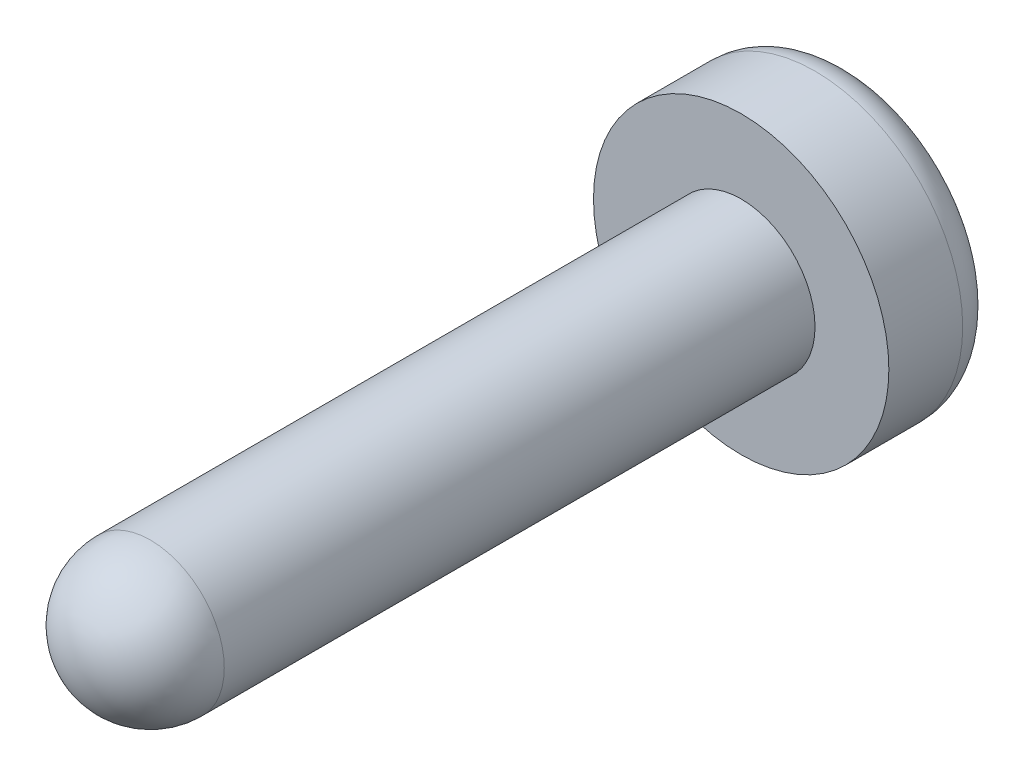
ISO-10303-21;
HEADER;
FILE_DESCRIPTION(('STEP AP214'),'2;1');
FILE_NAME('part.step','',(''),(''),'','','');
FILE_SCHEMA(('AUTOMOTIVE_DESIGN { 1 0 10303 214 1 1 1 1 }'));
ENDSEC;
DATA;
#1=APPLICATION_CONTEXT('core data for automotive mechanical design processes');
#2=APPLICATION_PROTOCOL_DEFINITION('international standard','automotive_design',2000,#1);
#3=PRODUCT_CONTEXT('',#1,'mechanical');
#4=PRODUCT('Part','Part','',(#3));
#5=PRODUCT_RELATED_PRODUCT_CATEGORY('part','',(#4));
#6=PRODUCT_DEFINITION_FORMATION('','',#4);
#7=PRODUCT_DEFINITION_CONTEXT('part definition',#1,'design');
#8=PRODUCT_DEFINITION('design','',#6,#7);
#9=PRODUCT_DEFINITION_SHAPE('','',#8);
#10=(LENGTH_UNIT() NAMED_UNIT(*) SI_UNIT(.MILLI.,.METRE.));
#11=(NAMED_UNIT(*) PLANE_ANGLE_UNIT() SI_UNIT($,.RADIAN.));
#12=(NAMED_UNIT(*) SI_UNIT($,.STERADIAN.) SOLID_ANGLE_UNIT());
#13=UNCERTAINTY_MEASURE_WITH_UNIT(LENGTH_MEASURE(1.E-05),#10,'distance_accuracy_value','');
#14=(GEOMETRIC_REPRESENTATION_CONTEXT(3) GLOBAL_UNCERTAINTY_ASSIGNED_CONTEXT((#13)) GLOBAL_UNIT_ASSIGNED_CONTEXT((#10,
#11,#12)) REPRESENTATION_CONTEXT('',''));
#15=CARTESIAN_POINT('',(0.,0.,0.));
#16=DIRECTION('',(0.,0.,1.));
#17=DIRECTION('',(1.,0.,0.));
#18=AXIS2_PLACEMENT_3D('',#15,#16,#17);
#19=CARTESIAN_POINT('',(0.,0.,1.5));
#20=DIRECTION('',(0.,0.,-1.));
#21=DIRECTION('',(-1.,0.,0.));
#22=AXIS2_PLACEMENT_3D('',#19,#20,#21);
#23=CYLINDRICAL_SURFACE('',#22,2.);
#24=CARTESIAN_POINT('',(0.,0.,0.5));
#25=DIRECTION('',(0.,0.,1.));
#26=DIRECTION('',(1.,0.,0.));
#27=AXIS2_PLACEMENT_3D('',#24,#25,#26);
#28=CIRCLE('',#27,2.);
#29=CARTESIAN_POINT('',(2.,0.,0.5));
#30=VERTEX_POINT('',#29);
#31=EDGE_CURVE('E49',#30,#30,#28,.T.);
#32=ORIENTED_EDGE('',*,*,#31,.T.);
#33=EDGE_LOOP('',(#32));
#34=FACE_BOUND('',#33,.T.);
#35=CARTESIAN_POINT('',(0.,0.,1.5));
#36=DIRECTION('',(0.,0.,1.));
#37=DIRECTION('',(1.,0.,0.));
#38=AXIS2_PLACEMENT_3D('',#35,#36,#37);
#39=CIRCLE('',#38,2.);
#40=CARTESIAN_POINT('',(2.,0.,1.5));
#41=VERTEX_POINT('',#40);
#42=EDGE_CURVE('E243',#41,#41,#39,.T.);
#43=ORIENTED_EDGE('',*,*,#42,.F.);
#44=EDGE_LOOP('',(#43));
#45=FACE_BOUND('',#44,.T.);
#46=ADVANCED_FACE('F40',(#34,#45),#23,.T.);
#47=CARTESIAN_POINT('',(0.,0.,1.5));
#48=DIRECTION('',(0.,0.,1.));
#49=DIRECTION('',(1.,0.,0.));
#50=AXIS2_PLACEMENT_3D('',#47,#48,#49);
#51=PLANE('',#50);
#52=CARTESIAN_POINT('',(0.,0.,1.5));
#53=DIRECTION('',(0.,0.,1.));
#54=DIRECTION('',(1.,0.,0.));
#55=AXIS2_PLACEMENT_3D('',#52,#53,#54);
#56=CIRCLE('',#55,1.);
#57=CARTESIAN_POINT('',(1.,0.,1.5));
#58=VERTEX_POINT('',#57);
#59=EDGE_CURVE('E212',#58,#58,#56,.T.);
#60=ORIENTED_EDGE('',*,*,#59,.F.);
#61=EDGE_LOOP('',(#60));
#62=FACE_BOUND('',#61,.T.);
#63=ORIENTED_EDGE('',*,*,#42,.T.);
#64=EDGE_LOOP('',(#63));
#65=FACE_BOUND('',#64,.T.);
#66=ADVANCED_FACE('F270',(#62,#65),#51,.T.);
#67=CARTESIAN_POINT('',(0.,0.,0.));
#68=DIRECTION('',(0.,0.,1.));
#69=DIRECTION('',(1.,0.,0.));
#70=AXIS2_PLACEMENT_3D('',#67,#68,#69);
#71=PLANE('',#70);
#72=DIRECTION('',(-1.,0.,0.));
#73=VECTOR('',#72,1.);
#74=CARTESIAN_POINT('',(0.,-0.358007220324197,0.));
#75=LINE('',#74,#73);
#76=CARTESIAN_POINT('',(1.14604795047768,-0.358007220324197,0.));
#77=VERTEX_POINT('',#76);
#78=CARTESIAN_POINT('',(0.316520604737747,-0.358007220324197,0.));
#79=VERTEX_POINT('',#78);
#80=EDGE_CURVE('E168',#77,#79,#75,.T.);
#81=ORIENTED_EDGE('',*,*,#80,.F.);
#82=DIRECTION('',(0.,-1.,0.));
#83=VECTOR('',#82,1.);
#84=CARTESIAN_POINT('',(1.14604795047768,0.,0.));
#85=LINE('',#84,#83);
#86=CARTESIAN_POINT('',(1.14604795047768,0.271500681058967,0.));
#87=VERTEX_POINT('',#86);
#88=EDGE_CURVE('E56',#87,#77,#85,.T.);
#89=ORIENTED_EDGE('',*,*,#88,.F.);
#90=DIRECTION('',(-1.,0.,0.));
#91=VECTOR('',#90,1.);
#92=CARTESIAN_POINT('',(0.,0.271500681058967,0.));
#93=LINE('',#92,#91);
#94=CARTESIAN_POINT('',(0.316520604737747,0.271500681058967,0.));
#95=VERTEX_POINT('',#94);
#96=EDGE_CURVE('E205',#87,#95,#93,.T.);
#97=ORIENTED_EDGE('',*,*,#96,.T.);
#98=DIRECTION('',(0.,-1.,0.));
#99=VECTOR('',#98,1.);
#100=CARTESIAN_POINT('',(0.316520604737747,0.,0.));
#101=LINE('',#100,#99);
#102=CARTESIAN_POINT('',(0.316520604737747,1.14319061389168,0.));
#103=VERTEX_POINT('',#102);
#104=EDGE_CURVE('E202',#103,#95,#101,.T.);
#105=ORIENTED_EDGE('',*,*,#104,.F.);
#106=DIRECTION('',(-1.,0.,0.));
#107=VECTOR('',#106,1.);
#108=CARTESIAN_POINT('',(0.,1.14319061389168,0.));
#109=LINE('',#108,#107);
#110=CARTESIAN_POINT('',(-0.315681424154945,1.14319061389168,0.));
#111=VERTEX_POINT('',#110);
#112=EDGE_CURVE('E138',#103,#111,#109,.T.);
#113=ORIENTED_EDGE('',*,*,#112,.T.);
#114=DIRECTION('',(0.,-1.,0.));
#115=VECTOR('',#114,1.);
#116=CARTESIAN_POINT('',(-0.315681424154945,0.,0.));
#117=LINE('',#116,#115);
#118=CARTESIAN_POINT('',(-0.315681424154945,0.271500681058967,0.));
#119=VERTEX_POINT('',#118);
#120=EDGE_CURVE('E196',#111,#119,#117,.T.);
#121=ORIENTED_EDGE('',*,*,#120,.T.);
#122=DIRECTION('',(-1.,0.,0.));
#123=VECTOR('',#122,1.);
#124=CARTESIAN_POINT('',(0.,0.271500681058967,0.));
#125=LINE('',#124,#123);
#126=CARTESIAN_POINT('',(-1.18817139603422,0.271500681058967,0.));
#127=VERTEX_POINT('',#126);
#128=EDGE_CURVE('E192',#119,#127,#125,.T.);
#129=ORIENTED_EDGE('',*,*,#128,.T.);
#130=DIRECTION('',(0.,-1.,0.));
#131=VECTOR('',#130,1.);
#132=CARTESIAN_POINT('',(-1.18817139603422,0.,0.));
#133=LINE('',#132,#131);
#134=CARTESIAN_POINT('',(-1.18817139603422,-0.358007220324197,0.));
#135=VERTEX_POINT('',#134);
#136=EDGE_CURVE('E188',#127,#135,#133,.T.);
#137=ORIENTED_EDGE('',*,*,#136,.T.);
#138=DIRECTION('',(-1.,0.,0.));
#139=VECTOR('',#138,1.);
#140=CARTESIAN_POINT('',(0.,-0.358007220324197,0.));
#141=LINE('',#140,#139);
#142=CARTESIAN_POINT('',(-0.315681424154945,-0.358007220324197,0.));
#143=VERTEX_POINT('',#142);
#144=EDGE_CURVE('E184',#143,#135,#141,.T.);
#145=ORIENTED_EDGE('',*,*,#144,.F.);
#146=DIRECTION('',(0.,-1.,0.));
#147=VECTOR('',#146,1.);
#148=CARTESIAN_POINT('',(-0.315681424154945,0.,0.));
#149=LINE('',#148,#147);
#150=CARTESIAN_POINT('',(-0.315681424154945,-1.21651623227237,0.));
#151=VERTEX_POINT('',#150);
#152=EDGE_CURVE('E180',#143,#151,#149,.T.);
#153=ORIENTED_EDGE('',*,*,#152,.T.);
#154=DIRECTION('',(-1.,0.,0.));
#155=VECTOR('',#154,1.);
#156=CARTESIAN_POINT('',(0.,-1.21651623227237,0.));
#157=LINE('',#156,#155);
#158=CARTESIAN_POINT('',(0.316520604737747,-1.21651623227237,0.));
#159=VERTEX_POINT('',#158);
#160=EDGE_CURVE('E176',#159,#151,#157,.T.);
#161=ORIENTED_EDGE('',*,*,#160,.F.);
#162=DIRECTION('',(0.,-1.,0.));
#163=VECTOR('',#162,1.);
#164=CARTESIAN_POINT('',(0.316520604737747,0.,0.));
#165=LINE('',#164,#163);
#166=EDGE_CURVE('E172',#79,#159,#165,.T.);
#167=ORIENTED_EDGE('',*,*,#166,.F.);
#168=EDGE_LOOP('',(#81,#89,#97,#105,#113,#121,#129,#137,#145,#153,#161,#167));
#169=FACE_BOUND('',#168,.T.);
#170=CARTESIAN_POINT('',(0.,0.,0.));
#171=DIRECTION('',(0.,0.,1.));
#172=DIRECTION('',(1.,0.,0.));
#173=AXIS2_PLACEMENT_3D('',#170,#171,#172);
#174=CIRCLE('',#173,1.5);
#175=CARTESIAN_POINT('',(1.5,0.,0.));
#176=VERTEX_POINT('',#175);
#177=EDGE_CURVE('E11',#176,#176,#174,.F.);
#178=ORIENTED_EDGE('',*,*,#177,.T.);
#179=EDGE_LOOP('',(#178));
#180=FACE_BOUND('',#179,.T.);
#181=ADVANCED_FACE('F275',(#169,#180),#71,.F.);
#182=CARTESIAN_POINT('',(0.,0.,10.5));
#183=DIRECTION('',(0.,0.,-1.));
#184=DIRECTION('',(-1.,0.,0.));
#185=AXIS2_PLACEMENT_3D('',#182,#183,#184);
#186=CYLINDRICAL_SURFACE('',#185,1.);
#187=CARTESIAN_POINT('',(0.,0.,9.5));
#188=DIRECTION('',(0.,0.,-1.));
#189=DIRECTION('',(-1.,0.,0.));
#190=AXIS2_PLACEMENT_3D('',#187,#188,#189);
#191=CIRCLE('',#190,1.);
#192=CARTESIAN_POINT('',(-1.,0.,9.5));
#193=VERTEX_POINT('',#192);
#194=EDGE_CURVE('E247',#193,#193,#191,.T.);
#195=ORIENTED_EDGE('',*,*,#194,.T.);
#196=EDGE_LOOP('',(#195));
#197=FACE_BOUND('',#196,.T.);
#198=ORIENTED_EDGE('',*,*,#59,.T.);
#199=EDGE_LOOP('',(#198));
#200=FACE_BOUND('',#199,.T.);
#201=ADVANCED_FACE('F266',(#197,#200),#186,.T.);
#202=CARTESIAN_POINT('',(0.,0.,9.5));
#203=DIRECTION('',(0.,0.,1.));
#204=DIRECTION('',(1.,0.,0.));
#205=AXIS2_PLACEMENT_3D('',#202,#203,#204);
#206=SPHERICAL_SURFACE('',#205,1.);
#207=ORIENTED_EDGE('',*,*,#194,.F.);
#208=EDGE_LOOP('',(#207));
#209=FACE_BOUND('',#208,.T.);
#210=ADVANCED_FACE('F258',(#209),#206,.T.);
#211=CARTESIAN_POINT('',(0.,0.,0.5));
#212=DIRECTION('',(0.,0.,1.));
#213=DIRECTION('',(1.,0.,0.));
#214=AXIS2_PLACEMENT_3D('',#211,#212,#213);
#215=TOROIDAL_SURFACE('',#214,1.5,0.5);
#216=ORIENTED_EDGE('',*,*,#177,.F.);
#217=EDGE_LOOP('',(#216));
#218=FACE_BOUND('',#217,.T.);
#219=ORIENTED_EDGE('',*,*,#31,.F.);
#220=EDGE_LOOP('',(#219));
#221=FACE_BOUND('',#220,.T.);
#222=ADVANCED_FACE('F42',(#218,#221),#215,.T.);
#223=CARTESIAN_POINT('',(1.14604795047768,0.,0.5));
#224=DIRECTION('',(1.,0.,0.));
#225=DIRECTION('',(0.,0.,-1.));
#226=AXIS2_PLACEMENT_3D('',#223,#224,#225);
#227=PLANE('',#226);
#228=ORIENTED_EDGE('',*,*,#88,.T.);
#229=DIRECTION('',(0.,0.,-1.));
#230=VECTOR('',#229,1.);
#231=CARTESIAN_POINT('',(1.14604795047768,-0.358007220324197,0.5));
#232=LINE('',#231,#230);
#233=CARTESIAN_POINT('',(1.14604795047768,-0.358007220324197,0.5));
#234=VERTEX_POINT('',#233);
#235=EDGE_CURVE('E104',#234,#77,#232,.T.);
#236=ORIENTED_EDGE('',*,*,#235,.F.);
#237=DIRECTION('',(0.,-1.,0.));
#238=VECTOR('',#237,1.);
#239=CARTESIAN_POINT('',(1.14604795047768,0.,0.5));
#240=LINE('',#239,#238);
#241=CARTESIAN_POINT('',(1.14604795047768,0.271500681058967,0.5));
#242=VERTEX_POINT('',#241);
#243=EDGE_CURVE('E209',#242,#234,#240,.T.);
#244=ORIENTED_EDGE('',*,*,#243,.F.);
#245=DIRECTION('',(0.,0.,-1.));
#246=VECTOR('',#245,1.);
#247=CARTESIAN_POINT('',(1.14604795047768,0.271500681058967,0.5));
#248=LINE('',#247,#246);
#249=EDGE_CURVE('E64',#242,#87,#248,.T.);
#250=ORIENTED_EDGE('',*,*,#249,.T.);
#251=EDGE_LOOP('',(#228,#236,#244,#250));
#252=FACE_BOUND('',#251,.T.);
#253=ADVANCED_FACE('F257',(#252),#227,.F.);
#254=CARTESIAN_POINT('',(0.,0.271500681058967,0.5));
#255=DIRECTION('',(0.,-1.,0.));
#256=DIRECTION('',(0.,0.,-1.));
#257=AXIS2_PLACEMENT_3D('',#254,#255,#256);
#258=PLANE('',#257);
#259=ORIENTED_EDGE('',*,*,#96,.F.);
#260=ORIENTED_EDGE('',*,*,#249,.F.);
#261=DIRECTION('',(-1.,0.,0.));
#262=VECTOR('',#261,1.);
#263=CARTESIAN_POINT('',(0.,0.271500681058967,0.5));
#264=LINE('',#263,#262);
#265=CARTESIAN_POINT('',(0.316520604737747,0.271500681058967,0.5));
#266=VERTEX_POINT('',#265);
#267=EDGE_CURVE('E160',#242,#266,#264,.T.);
#268=ORIENTED_EDGE('',*,*,#267,.T.);
#269=DIRECTION('',(0.,0.,-1.));
#270=VECTOR('',#269,1.);
#271=CARTESIAN_POINT('',(0.316520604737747,0.271500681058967,0.5));
#272=LINE('',#271,#270);
#273=EDGE_CURVE('E144',#266,#95,#272,.T.);
#274=ORIENTED_EDGE('',*,*,#273,.T.);
#275=EDGE_LOOP('',(#259,#260,#268,#274));
#276=FACE_BOUND('',#275,.T.);
#277=ADVANCED_FACE('F264',(#276),#258,.T.);
#278=CARTESIAN_POINT('',(0.316520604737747,0.,0.5));
#279=DIRECTION('',(1.,0.,0.));
#280=DIRECTION('',(0.,0.,-1.));
#281=AXIS2_PLACEMENT_3D('',#278,#279,#280);
#282=PLANE('',#281);
#283=ORIENTED_EDGE('',*,*,#104,.T.);
#284=ORIENTED_EDGE('',*,*,#273,.F.);
#285=DIRECTION('',(0.,-1.,0.));
#286=VECTOR('',#285,1.);
#287=CARTESIAN_POINT('',(0.316520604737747,0.,0.5));
#288=LINE('',#287,#286);
#289=CARTESIAN_POINT('',(0.316520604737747,1.14319061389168,0.5));
#290=VERTEX_POINT('',#289);
#291=EDGE_CURVE('E152',#290,#266,#288,.T.);
#292=ORIENTED_EDGE('',*,*,#291,.F.);
#293=DIRECTION('',(0.,0.,-1.));
#294=VECTOR('',#293,1.);
#295=CARTESIAN_POINT('',(0.316520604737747,1.14319061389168,0.5));
#296=LINE('',#295,#294);
#297=EDGE_CURVE('E132',#290,#103,#296,.T.);
#298=ORIENTED_EDGE('',*,*,#297,.T.);
#299=EDGE_LOOP('',(#283,#284,#292,#298));
#300=FACE_BOUND('',#299,.T.);
#301=ADVANCED_FACE('F158',(#300),#282,.F.);
#302=CARTESIAN_POINT('',(0.,1.14319061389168,0.5));
#303=DIRECTION('',(0.,-1.,0.));
#304=DIRECTION('',(0.,0.,-1.));
#305=AXIS2_PLACEMENT_3D('',#302,#303,#304);
#306=PLANE('',#305);
#307=ORIENTED_EDGE('',*,*,#112,.F.);
#308=ORIENTED_EDGE('',*,*,#297,.F.);
#309=DIRECTION('',(-1.,0.,0.));
#310=VECTOR('',#309,1.);
#311=CARTESIAN_POINT('',(0.,1.14319061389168,0.5));
#312=LINE('',#311,#310);
#313=CARTESIAN_POINT('',(-0.315681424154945,1.14319061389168,0.5));
#314=VERTEX_POINT('',#313);
#315=EDGE_CURVE('E135',#290,#314,#312,.T.);
#316=ORIENTED_EDGE('',*,*,#315,.T.);
#317=DIRECTION('',(0.,0.,-1.));
#318=VECTOR('',#317,1.);
#319=CARTESIAN_POINT('',(-0.315681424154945,1.14319061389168,0.5));
#320=LINE('',#319,#318);
#321=EDGE_CURVE('E145',#314,#111,#320,.T.);
#322=ORIENTED_EDGE('',*,*,#321,.T.);
#323=EDGE_LOOP('',(#307,#308,#316,#322));
#324=FACE_BOUND('',#323,.T.);
#325=ADVANCED_FACE('F134',(#324),#306,.T.);
#326=CARTESIAN_POINT('',(-0.315681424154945,0.,0.5));
#327=DIRECTION('',(1.,0.,0.));
#328=DIRECTION('',(0.,0.,-1.));
#329=AXIS2_PLACEMENT_3D('',#326,#327,#328);
#330=PLANE('',#329);
#331=ORIENTED_EDGE('',*,*,#120,.F.);
#332=ORIENTED_EDGE('',*,*,#321,.F.);
#333=DIRECTION('',(0.,-1.,0.));
#334=VECTOR('',#333,1.);
#335=CARTESIAN_POINT('',(-0.315681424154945,0.,0.5));
#336=LINE('',#335,#334);
#337=CARTESIAN_POINT('',(-0.315681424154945,0.271500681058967,0.5));
#338=VERTEX_POINT('',#337);
#339=EDGE_CURVE('E154',#314,#338,#336,.T.);
#340=ORIENTED_EDGE('',*,*,#339,.T.);
#341=DIRECTION('',(0.,0.,-1.));
#342=VECTOR('',#341,1.);
#343=CARTESIAN_POINT('',(-0.315681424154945,0.271500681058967,0.5));
#344=LINE('',#343,#342);
#345=EDGE_CURVE('E217',#338,#119,#344,.T.);
#346=ORIENTED_EDGE('',*,*,#345,.T.);
#347=EDGE_LOOP('',(#331,#332,#340,#346));
#348=FACE_BOUND('',#347,.T.);
#349=ADVANCED_FACE('F312',(#348),#330,.T.);
#350=CARTESIAN_POINT('',(0.,0.271500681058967,0.5));
#351=DIRECTION('',(0.,-1.,0.));
#352=DIRECTION('',(0.,0.,-1.));
#353=AXIS2_PLACEMENT_3D('',#350,#351,#352);
#354=PLANE('',#353);
#355=ORIENTED_EDGE('',*,*,#128,.F.);
#356=ORIENTED_EDGE('',*,*,#345,.F.);
#357=DIRECTION('',(-1.,0.,0.));
#358=VECTOR('',#357,1.);
#359=CARTESIAN_POINT('',(0.,0.271500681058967,0.5));
#360=LINE('',#359,#358);
#361=CARTESIAN_POINT('',(-1.18817139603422,0.271500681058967,0.5));
#362=VERTEX_POINT('',#361);
#363=EDGE_CURVE('E473',#338,#362,#360,.T.);
#364=ORIENTED_EDGE('',*,*,#363,.T.);
#365=DIRECTION('',(0.,0.,-1.));
#366=VECTOR('',#365,1.);
#367=CARTESIAN_POINT('',(-1.18817139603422,0.271500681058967,0.5));
#368=LINE('',#367,#366);
#369=EDGE_CURVE('E220',#362,#127,#368,.T.);
#370=ORIENTED_EDGE('',*,*,#369,.T.);
#371=EDGE_LOOP('',(#355,#356,#364,#370));
#372=FACE_BOUND('',#371,.T.);
#373=ADVANCED_FACE('F308',(#372),#354,.T.);
#374=CARTESIAN_POINT('',(-1.18817139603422,0.,0.5));
#375=DIRECTION('',(1.,0.,0.));
#376=DIRECTION('',(0.,0.,-1.));
#377=AXIS2_PLACEMENT_3D('',#374,#375,#376);
#378=PLANE('',#377);
#379=ORIENTED_EDGE('',*,*,#136,.F.);
#380=ORIENTED_EDGE('',*,*,#369,.F.);
#381=DIRECTION('',(0.,-1.,0.));
#382=VECTOR('',#381,1.);
#383=CARTESIAN_POINT('',(-1.18817139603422,0.,0.5));
#384=LINE('',#383,#382);
#385=CARTESIAN_POINT('',(-1.18817139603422,-0.358007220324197,0.5));
#386=VERTEX_POINT('',#385);
#387=EDGE_CURVE('E470',#362,#386,#384,.T.);
#388=ORIENTED_EDGE('',*,*,#387,.T.);
#389=DIRECTION('',(0.,0.,-1.));
#390=VECTOR('',#389,1.);
#391=CARTESIAN_POINT('',(-1.18817139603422,-0.358007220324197,0.5));
#392=LINE('',#391,#390);
#393=EDGE_CURVE('E223',#386,#135,#392,.T.);
#394=ORIENTED_EDGE('',*,*,#393,.T.);
#395=EDGE_LOOP('',(#379,#380,#388,#394));
#396=FACE_BOUND('',#395,.T.);
#397=ADVANCED_FACE('F304',(#396),#378,.T.);
#398=CARTESIAN_POINT('',(0.,-0.358007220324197,0.5));
#399=DIRECTION('',(0.,-1.,0.));
#400=DIRECTION('',(0.,0.,-1.));
#401=AXIS2_PLACEMENT_3D('',#398,#399,#400);
#402=PLANE('',#401);
#403=ORIENTED_EDGE('',*,*,#144,.T.);
#404=ORIENTED_EDGE('',*,*,#393,.F.);
#405=DIRECTION('',(-1.,0.,0.));
#406=VECTOR('',#405,1.);
#407=CARTESIAN_POINT('',(0.,-0.358007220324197,0.5));
#408=LINE('',#407,#406);
#409=CARTESIAN_POINT('',(-0.315681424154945,-0.358007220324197,0.5));
#410=VERTEX_POINT('',#409);
#411=EDGE_CURVE('E466',#410,#386,#408,.T.);
#412=ORIENTED_EDGE('',*,*,#411,.F.);
#413=DIRECTION('',(0.,0.,-1.));
#414=VECTOR('',#413,1.);
#415=CARTESIAN_POINT('',(-0.315681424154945,-0.358007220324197,0.5));
#416=LINE('',#415,#414);
#417=EDGE_CURVE('E226',#410,#143,#416,.T.);
#418=ORIENTED_EDGE('',*,*,#417,.T.);
#419=EDGE_LOOP('',(#403,#404,#412,#418));
#420=FACE_BOUND('',#419,.T.);
#421=ADVANCED_FACE('F300',(#420),#402,.F.);
#422=CARTESIAN_POINT('',(-0.315681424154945,0.,0.5));
#423=DIRECTION('',(1.,0.,0.));
#424=DIRECTION('',(0.,0.,-1.));
#425=AXIS2_PLACEMENT_3D('',#422,#423,#424);
#426=PLANE('',#425);
#427=ORIENTED_EDGE('',*,*,#152,.F.);
#428=ORIENTED_EDGE('',*,*,#417,.F.);
#429=DIRECTION('',(0.,-1.,0.));
#430=VECTOR('',#429,1.);
#431=CARTESIAN_POINT('',(-0.315681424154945,0.,0.5));
#432=LINE('',#431,#430);
#433=CARTESIAN_POINT('',(-0.315681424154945,-1.21651623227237,0.5));
#434=VERTEX_POINT('',#433);
#435=EDGE_CURVE('E463',#410,#434,#432,.T.);
#436=ORIENTED_EDGE('',*,*,#435,.T.);
#437=DIRECTION('',(0.,0.,-1.));
#438=VECTOR('',#437,1.);
#439=CARTESIAN_POINT('',(-0.315681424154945,-1.21651623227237,0.5));
#440=LINE('',#439,#438);
#441=EDGE_CURVE('E229',#434,#151,#440,.T.);
#442=ORIENTED_EDGE('',*,*,#441,.T.);
#443=EDGE_LOOP('',(#427,#428,#436,#442));
#444=FACE_BOUND('',#443,.T.);
#445=ADVANCED_FACE('F296',(#444),#426,.T.);
#446=CARTESIAN_POINT('',(0.,-1.21651623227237,0.5));
#447=DIRECTION('',(0.,-1.,0.));
#448=DIRECTION('',(0.,0.,-1.));
#449=AXIS2_PLACEMENT_3D('',#446,#447,#448);
#450=PLANE('',#449);
#451=ORIENTED_EDGE('',*,*,#160,.T.);
#452=ORIENTED_EDGE('',*,*,#441,.F.);
#453=DIRECTION('',(-1.,0.,0.));
#454=VECTOR('',#453,1.);
#455=CARTESIAN_POINT('',(0.,-1.21651623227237,0.5));
#456=LINE('',#455,#454);
#457=CARTESIAN_POINT('',(0.316520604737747,-1.21651623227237,0.5));
#458=VERTEX_POINT('',#457);
#459=EDGE_CURVE('E459',#458,#434,#456,.T.);
#460=ORIENTED_EDGE('',*,*,#459,.F.);
#461=DIRECTION('',(0.,0.,-1.));
#462=VECTOR('',#461,1.);
#463=CARTESIAN_POINT('',(0.316520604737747,-1.21651623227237,0.5));
#464=LINE('',#463,#462);
#465=EDGE_CURVE('E232',#458,#159,#464,.T.);
#466=ORIENTED_EDGE('',*,*,#465,.T.);
#467=EDGE_LOOP('',(#451,#452,#460,#466));
#468=FACE_BOUND('',#467,.T.);
#469=ADVANCED_FACE('F292',(#468),#450,.F.);
#470=CARTESIAN_POINT('',(0.316520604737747,0.,0.5));
#471=DIRECTION('',(1.,0.,0.));
#472=DIRECTION('',(0.,0.,-1.));
#473=AXIS2_PLACEMENT_3D('',#470,#471,#472);
#474=PLANE('',#473);
#475=ORIENTED_EDGE('',*,*,#166,.T.);
#476=ORIENTED_EDGE('',*,*,#465,.F.);
#477=DIRECTION('',(0.,-1.,0.));
#478=VECTOR('',#477,1.);
#479=CARTESIAN_POINT('',(0.316520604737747,0.,0.5));
#480=LINE('',#479,#478);
#481=CARTESIAN_POINT('',(0.316520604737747,-0.358007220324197,0.5));
#482=VERTEX_POINT('',#481);
#483=EDGE_CURVE('E452',#482,#458,#480,.T.);
#484=ORIENTED_EDGE('',*,*,#483,.F.);
#485=DIRECTION('',(0.,0.,-1.));
#486=VECTOR('',#485,1.);
#487=CARTESIAN_POINT('',(0.316520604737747,-0.358007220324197,0.5));
#488=LINE('',#487,#486);
#489=EDGE_CURVE('E235',#482,#79,#488,.T.);
#490=ORIENTED_EDGE('',*,*,#489,.T.);
#491=EDGE_LOOP('',(#475,#476,#484,#490));
#492=FACE_BOUND('',#491,.T.);
#493=ADVANCED_FACE('F288',(#492),#474,.F.);
#494=CARTESIAN_POINT('',(0.,-0.358007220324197,0.5));
#495=DIRECTION('',(0.,-1.,0.));
#496=DIRECTION('',(0.,0.,-1.));
#497=AXIS2_PLACEMENT_3D('',#494,#495,#496);
#498=PLANE('',#497);
#499=ORIENTED_EDGE('',*,*,#80,.T.);
#500=ORIENTED_EDGE('',*,*,#489,.F.);
#501=DIRECTION('',(-1.,0.,0.));
#502=VECTOR('',#501,1.);
#503=CARTESIAN_POINT('',(0.,-0.358007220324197,0.5));
#504=LINE('',#503,#502);
#505=EDGE_CURVE('E449',#234,#482,#504,.T.);
#506=ORIENTED_EDGE('',*,*,#505,.F.);
#507=ORIENTED_EDGE('',*,*,#235,.T.);
#508=EDGE_LOOP('',(#499,#500,#506,#507));
#509=FACE_BOUND('',#508,.T.);
#510=ADVANCED_FACE('F285',(#509),#498,.F.);
#511=CARTESIAN_POINT('',(0.,0.,0.5));
#512=DIRECTION('',(0.,0.,-1.));
#513=DIRECTION('',(-1.,0.,0.));
#514=AXIS2_PLACEMENT_3D('',#511,#512,#513);
#515=PLANE('',#514);
#516=ORIENTED_EDGE('',*,*,#243,.T.);
#517=ORIENTED_EDGE('',*,*,#505,.T.);
#518=ORIENTED_EDGE('',*,*,#483,.T.);
#519=ORIENTED_EDGE('',*,*,#459,.T.);
#520=ORIENTED_EDGE('',*,*,#435,.F.);
#521=ORIENTED_EDGE('',*,*,#411,.T.);
#522=ORIENTED_EDGE('',*,*,#387,.F.);
#523=ORIENTED_EDGE('',*,*,#363,.F.);
#524=ORIENTED_EDGE('',*,*,#339,.F.);
#525=ORIENTED_EDGE('',*,*,#315,.F.);
#526=ORIENTED_EDGE('',*,*,#291,.T.);
#527=ORIENTED_EDGE('',*,*,#267,.F.);
#528=EDGE_LOOP('',(#516,#517,#518,#519,#520,#521,#522,#523,#524,#525,#526,#527));
#529=FACE_BOUND('',#528,.T.);
#530=ADVANCED_FACE('F151',(#529),#515,.T.);
#531=CLOSED_SHELL('',(#46,#66,#181,#201,#210,#222,#253,#277,#301,#325,#349,#373,#397,#421,#445,
#469,#493,#510,#530));
#532=MANIFOLD_SOLID_BREP('B2',#531);
#533=ADVANCED_BREP_SHAPE_REPRESENTATION('',(#18,#532),#14);
#534=SHAPE_DEFINITION_REPRESENTATION(#9,#533);
ENDSEC;
END-ISO-10303-21;
